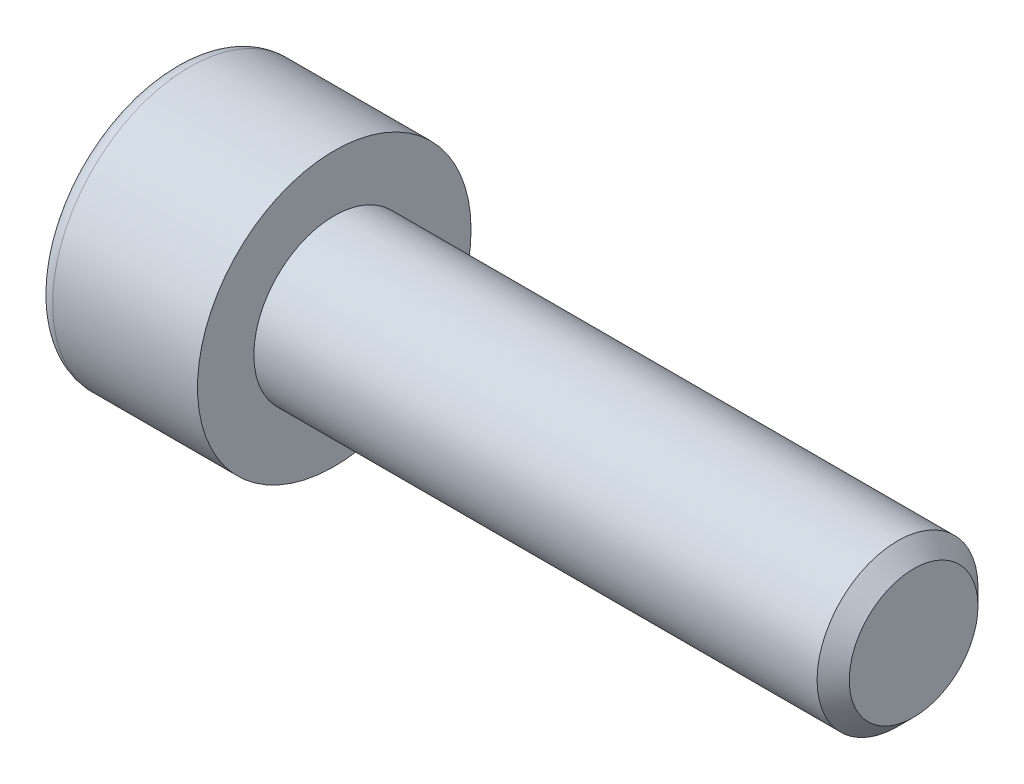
ISO-10303-21;
HEADER;
FILE_DESCRIPTION(('STEP AP214'),'2;1');
FILE_NAME('part.step','',(''),(''),'','','');
FILE_SCHEMA(('AUTOMOTIVE_DESIGN { 1 0 10303 214 1 1 1 1 }'));
ENDSEC;
DATA;
#1=APPLICATION_CONTEXT('core data for automotive mechanical design processes');
#2=APPLICATION_PROTOCOL_DEFINITION('international standard','automotive_design',2000,#1);
#3=PRODUCT_CONTEXT('',#1,'mechanical');
#4=PRODUCT('Part','Part','',(#3));
#5=PRODUCT_RELATED_PRODUCT_CATEGORY('part','',(#4));
#6=PRODUCT_DEFINITION_FORMATION('','',#4);
#7=PRODUCT_DEFINITION_CONTEXT('part definition',#1,'design');
#8=PRODUCT_DEFINITION('design','',#6,#7);
#9=PRODUCT_DEFINITION_SHAPE('','',#8);
#10=(LENGTH_UNIT() NAMED_UNIT(*) SI_UNIT(.MILLI.,.METRE.));
#11=(NAMED_UNIT(*) PLANE_ANGLE_UNIT() SI_UNIT($,.RADIAN.));
#12=(NAMED_UNIT(*) SI_UNIT($,.STERADIAN.) SOLID_ANGLE_UNIT());
#13=UNCERTAINTY_MEASURE_WITH_UNIT(LENGTH_MEASURE(1.E-05),#10,'distance_accuracy_value','');
#14=(GEOMETRIC_REPRESENTATION_CONTEXT(3) GLOBAL_UNCERTAINTY_ASSIGNED_CONTEXT((#13)) GLOBAL_UNIT_ASSIGNED_CONTEXT((#10,
#11,#12)) REPRESENTATION_CONTEXT('',''));
#15=CARTESIAN_POINT('',(0.,0.,0.));
#16=DIRECTION('',(0.,0.,1.));
#17=DIRECTION('',(1.,0.,0.));
#18=AXIS2_PLACEMENT_3D('',#15,#16,#17);
#19=CARTESIAN_POINT('',(-5.,0.,-3.7500000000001));
#20=DIRECTION('',(-1.,0.,0.));
#21=DIRECTION('',(0.,0.,1.));
#22=AXIS2_PLACEMENT_3D('',#19,#20,#21);
#23=PLANE('',#22);
#24=CARTESIAN_POINT('',(-5.,0.,0.));
#25=DIRECTION('',(1.,0.,0.));
#26=DIRECTION('',(0.,0.,-1.));
#27=AXIS2_PLACEMENT_3D('',#24,#25,#26);
#28=CIRCLE('',#27,3.75);
#29=CARTESIAN_POINT('',(-5.,0.,-3.75));
#30=VERTEX_POINT('',#29);
#31=EDGE_CURVE('E468',#30,#30,#28,.T.);
#32=ORIENTED_EDGE('',*,*,#31,.F.);
#33=EDGE_LOOP('',(#32));
#34=FACE_BOUND('',#33,.T.);
#35=DIRECTION('',(0.,0.,-1.));
#36=VECTOR('',#35,1.);
#37=CARTESIAN_POINT('',(-5.,-1.99999999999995,1.15470053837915));
#38=LINE('',#37,#36);
#39=CARTESIAN_POINT('',(-5.,-1.99999999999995,1.15470053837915));
#40=VERTEX_POINT('',#39);
#41=CARTESIAN_POINT('',(-5.,-1.99999999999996,-1.15470053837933));
#42=VERTEX_POINT('',#41);
#43=EDGE_CURVE('E431',#40,#42,#38,.T.);
#44=ORIENTED_EDGE('',*,*,#43,.T.);
#45=DIRECTION('',(0.,0.866025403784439,-0.5));
#46=VECTOR('',#45,1.);
#47=CARTESIAN_POINT('',(-5.,-1.99999999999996,-1.15470053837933));
#48=LINE('',#47,#46);
#49=CARTESIAN_POINT('',(-5.,0.,-2.30940107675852));
#50=VERTEX_POINT('',#49);
#51=EDGE_CURVE('E373',#42,#50,#48,.T.);
#52=ORIENTED_EDGE('',*,*,#51,.T.);
#53=DIRECTION('',(0.,-0.86602540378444,-0.500000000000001));
#54=VECTOR('',#53,1.);
#55=CARTESIAN_POINT('',(-5.,2.,-1.15470053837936));
#56=LINE('',#55,#54);
#57=CARTESIAN_POINT('',(-5.,2.,-1.15470053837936));
#58=VERTEX_POINT('',#57);
#59=EDGE_CURVE('E421',#58,#50,#56,.T.);
#60=ORIENTED_EDGE('',*,*,#59,.F.);
#61=DIRECTION('',(0.,0.,-1.));
#62=VECTOR('',#61,1.);
#63=CARTESIAN_POINT('',(-5.,2.0000000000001,1.1547005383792));
#64=LINE('',#63,#62);
#65=CARTESIAN_POINT('',(-5.,2.0000000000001,1.1547005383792));
#66=VERTEX_POINT('',#65);
#67=EDGE_CURVE('E426',#66,#58,#64,.T.);
#68=ORIENTED_EDGE('',*,*,#67,.F.);
#69=DIRECTION('',(0.,-0.866025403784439,0.5));
#70=VECTOR('',#69,1.);
#71=CARTESIAN_POINT('',(-5.,2.0000000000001,1.1547005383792));
#72=LINE('',#71,#70);
#73=CARTESIAN_POINT('',(-5.,0.,2.30940107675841));
#74=VERTEX_POINT('',#73);
#75=EDGE_CURVE('E435',#66,#74,#72,.T.);
#76=ORIENTED_EDGE('',*,*,#75,.T.);
#77=DIRECTION('',(0.,0.86602540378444,0.500000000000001));
#78=VECTOR('',#77,1.);
#79=CARTESIAN_POINT('',(-5.,-1.99999999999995,1.15470053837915));
#80=LINE('',#79,#78);
#81=EDGE_CURVE('E438',#40,#74,#80,.T.);
#82=ORIENTED_EDGE('',*,*,#81,.F.);
#83=EDGE_LOOP('',(#44,#52,#60,#68,#76,#82));
#84=FACE_BOUND('',#83,.T.);
#85=ADVANCED_FACE('F358',(#34,#84),#23,.T.);
#86=CARTESIAN_POINT('',(0.,0.,0.));
#87=DIRECTION('',(-1.,0.,0.));
#88=DIRECTION('',(0.,0.,1.));
#89=AXIS2_PLACEMENT_3D('',#86,#87,#88);
#90=CYLINDRICAL_SURFACE('',#89,2.50000000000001);
#91=CARTESIAN_POINT('',(17.5,0.,0.));
#92=DIRECTION('',(1.,0.,0.));
#93=DIRECTION('',(0.,0.,-1.));
#94=AXIS2_PLACEMENT_3D('',#91,#92,#93);
#95=CIRCLE('',#94,2.50000000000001);
#96=CARTESIAN_POINT('',(17.5,0.,-2.50000000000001));
#97=VERTEX_POINT('',#96);
#98=EDGE_CURVE('E366',#97,#97,#95,.F.);
#99=ORIENTED_EDGE('',*,*,#98,.T.);
#100=EDGE_LOOP('',(#99));
#101=FACE_BOUND('',#100,.T.);
#102=CARTESIAN_POINT('',(0.,0.,0.));
#103=DIRECTION('',(-1.,0.,0.));
#104=DIRECTION('',(0.,0.,1.));
#105=AXIS2_PLACEMENT_3D('',#102,#103,#104);
#106=CIRCLE('',#105,2.50000000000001);
#107=CARTESIAN_POINT('',(0.,0.,2.50000000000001));
#108=VERTEX_POINT('',#107);
#109=EDGE_CURVE('E471',#108,#108,#106,.T.);
#110=ORIENTED_EDGE('',*,*,#109,.F.);
#111=EDGE_LOOP('',(#110));
#112=FACE_BOUND('',#111,.T.);
#113=ADVANCED_FACE('F360',(#101,#112),#90,.T.);
#114=CARTESIAN_POINT('',(18.,0.,-2.50000000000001));
#115=DIRECTION('',(1.,0.,0.));
#116=DIRECTION('',(0.,0.,-1.));
#117=AXIS2_PLACEMENT_3D('',#114,#115,#116);
#118=PLANE('',#117);
#119=CARTESIAN_POINT('',(18.,0.,0.));
#120=DIRECTION('',(1.,0.,0.));
#121=DIRECTION('',(0.,0.,-1.));
#122=AXIS2_PLACEMENT_3D('',#119,#120,#121);
#123=CIRCLE('',#122,2.);
#124=CARTESIAN_POINT('',(18.,0.,-2.));
#125=VERTEX_POINT('',#124);
#126=EDGE_CURVE('E13',#125,#125,#123,.T.);
#127=ORIENTED_EDGE('',*,*,#126,.T.);
#128=EDGE_LOOP('',(#127));
#129=FACE_BOUND('',#128,.T.);
#130=ADVANCED_FACE('F481',(#129),#118,.T.);
#131=CARTESIAN_POINT('',(17.5,0.,0.));
#132=DIRECTION('',(-1.,0.,0.));
#133=DIRECTION('',(0.,0.,1.));
#134=AXIS2_PLACEMENT_3D('',#131,#132,#133);
#135=CONICAL_SURFACE('',#134,2.50000000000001,0.785398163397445);
#136=ORIENTED_EDGE('',*,*,#126,.F.);
#137=EDGE_LOOP('',(#136));
#138=FACE_BOUND('',#137,.T.);
#139=ORIENTED_EDGE('',*,*,#98,.F.);
#140=EDGE_LOOP('',(#139));
#141=FACE_BOUND('',#140,.T.);
#142=ADVANCED_FACE('F478',(#138,#141),#135,.T.);
#143=CARTESIAN_POINT('',(0.,0.,0.));
#144=DIRECTION('',(1.,0.,0.));
#145=DIRECTION('',(0.,0.,-1.));
#146=AXIS2_PLACEMENT_3D('',#143,#144,#145);
#147=PLANE('',#146);
#148=CARTESIAN_POINT('',(0.,0.,0.));
#149=DIRECTION('',(1.,0.,0.));
#150=DIRECTION('',(0.,0.,-1.));
#151=AXIS2_PLACEMENT_3D('',#148,#149,#150);
#152=CIRCLE('',#151,4.25);
#153=CARTESIAN_POINT('',(0.,0.,-4.25));
#154=VERTEX_POINT('',#153);
#155=EDGE_CURVE('E417',#154,#154,#152,.T.);
#156=ORIENTED_EDGE('',*,*,#155,.T.);
#157=EDGE_LOOP('',(#156));
#158=FACE_BOUND('',#157,.T.);
#159=ORIENTED_EDGE('',*,*,#109,.T.);
#160=EDGE_LOOP('',(#159));
#161=FACE_BOUND('',#160,.T.);
#162=ADVANCED_FACE('F480',(#158,#161),#147,.T.);
#163=CARTESIAN_POINT('',(-4.5,0.,0.));
#164=DIRECTION('',(1.,0.,0.));
#165=DIRECTION('',(0.,0.,-1.));
#166=AXIS2_PLACEMENT_3D('',#163,#164,#165);
#167=TOROIDAL_SURFACE('',#166,3.75,0.499999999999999);
#168=CARTESIAN_POINT('',(-4.5,0.,0.));
#169=DIRECTION('',(1.,0.,0.));
#170=DIRECTION('',(0.,0.,-1.));
#171=AXIS2_PLACEMENT_3D('',#168,#169,#170);
#172=CIRCLE('',#171,4.25);
#173=CARTESIAN_POINT('',(-4.5,0.,-4.25));
#174=VERTEX_POINT('',#173);
#175=EDGE_CURVE('E465',#174,#174,#172,.T.);
#176=ORIENTED_EDGE('',*,*,#175,.F.);
#177=EDGE_LOOP('',(#176));
#178=FACE_BOUND('',#177,.T.);
#179=ORIENTED_EDGE('',*,*,#31,.T.);
#180=EDGE_LOOP('',(#179));
#181=FACE_BOUND('',#180,.T.);
#182=ADVANCED_FACE('F489',(#178,#181),#167,.T.);
#183=CARTESIAN_POINT('',(0.,0.,0.));
#184=DIRECTION('',(1.,0.,0.));
#185=DIRECTION('',(0.,0.,-1.));
#186=AXIS2_PLACEMENT_3D('',#183,#184,#185);
#187=CYLINDRICAL_SURFACE('',#186,4.25);
#188=ORIENTED_EDGE('',*,*,#155,.F.);
#189=EDGE_LOOP('',(#188));
#190=FACE_BOUND('',#189,.T.);
#191=ORIENTED_EDGE('',*,*,#175,.T.);
#192=EDGE_LOOP('',(#191));
#193=FACE_BOUND('',#192,.T.);
#194=ADVANCED_FACE('F504',(#190,#193),#187,.T.);
#195=CARTESIAN_POINT('',(0.,-1.99999999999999,-1.15470053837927));
#196=DIRECTION('',(0.,0.5,0.866025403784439));
#197=DIRECTION('',(0.,-0.866025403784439,0.5));
#198=AXIS2_PLACEMENT_3D('',#195,#196,#197);
#199=PLANE('',#198);
#200=ORIENTED_EDGE('',*,*,#51,.F.);
#201=DIRECTION('',(-1.,0.,0.));
#202=VECTOR('',#201,1.);
#203=CARTESIAN_POINT('',(0.,-1.99999999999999,-1.15470053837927));
#204=LINE('',#203,#202);
#205=CARTESIAN_POINT('',(0.,-1.99999999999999,-1.15470053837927));
#206=VERTEX_POINT('',#205);
#207=EDGE_CURVE('E454',#206,#42,#204,.T.);
#208=ORIENTED_EDGE('',*,*,#207,.F.);
#209=DIRECTION('',(0.,0.866025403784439,-0.5));
#210=VECTOR('',#209,1.);
#211=CARTESIAN_POINT('',(0.,-1.99999999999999,-1.15470053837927));
#212=LINE('',#211,#210);
#213=CARTESIAN_POINT('',(0.,0.,-2.30940107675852));
#214=VERTEX_POINT('',#213);
#215=EDGE_CURVE('E413',#206,#214,#212,.T.);
#216=ORIENTED_EDGE('',*,*,#215,.T.);
#217=DIRECTION('',(-1.,0.,0.));
#218=VECTOR('',#217,1.);
#219=CARTESIAN_POINT('',(0.,0.,-2.30940107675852));
#220=LINE('',#219,#218);
#221=EDGE_CURVE('E409',#214,#50,#220,.T.);
#222=ORIENTED_EDGE('',*,*,#221,.T.);
#223=EDGE_LOOP('',(#200,#208,#216,#222));
#224=FACE_BOUND('',#223,.T.);
#225=ADVANCED_FACE('F411',(#224),#199,.T.);
#226=CARTESIAN_POINT('',(0.,1.99999999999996,-1.15470053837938));
#227=DIRECTION('',(0.,0.500000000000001,-0.86602540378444));
#228=DIRECTION('',(0.,0.86602540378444,0.500000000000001));
#229=AXIS2_PLACEMENT_3D('',#226,#227,#228);
#230=PLANE('',#229);
#231=ORIENTED_EDGE('',*,*,#59,.T.);
#232=ORIENTED_EDGE('',*,*,#221,.F.);
#233=DIRECTION('',(0.,-0.86602540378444,-0.500000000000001));
#234=VECTOR('',#233,1.);
#235=CARTESIAN_POINT('',(0.,1.99999999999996,-1.15470053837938));
#236=LINE('',#235,#234);
#237=CARTESIAN_POINT('',(0.,1.99999999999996,-1.15470053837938));
#238=VERTEX_POINT('',#237);
#239=EDGE_CURVE('E443',#238,#214,#236,.T.);
#240=ORIENTED_EDGE('',*,*,#239,.F.);
#241=DIRECTION('',(-1.,0.,0.));
#242=VECTOR('',#241,1.);
#243=CARTESIAN_POINT('',(0.,1.99999999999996,-1.15470053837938));
#244=LINE('',#243,#242);
#245=EDGE_CURVE('E418',#238,#58,#244,.T.);
#246=ORIENTED_EDGE('',*,*,#245,.T.);
#247=EDGE_LOOP('',(#231,#232,#240,#246));
#248=FACE_BOUND('',#247,.T.);
#249=ADVANCED_FACE('F422',(#248),#230,.F.);
#250=CARTESIAN_POINT('',(0.,2.00000000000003,1.15470053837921));
#251=DIRECTION('',(0.,1.,0.));
#252=DIRECTION('',(-1.,0.,0.));
#253=AXIS2_PLACEMENT_3D('',#250,#251,#252);
#254=PLANE('',#253);
#255=ORIENTED_EDGE('',*,*,#67,.T.);
#256=ORIENTED_EDGE('',*,*,#245,.F.);
#257=DIRECTION('',(0.,0.,-1.));
#258=VECTOR('',#257,1.);
#259=CARTESIAN_POINT('',(0.,2.00000000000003,1.15470053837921));
#260=LINE('',#259,#258);
#261=CARTESIAN_POINT('',(0.,2.00000000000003,1.15470053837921));
#262=VERTEX_POINT('',#261);
#263=EDGE_CURVE('E445',#262,#238,#260,.T.);
#264=ORIENTED_EDGE('',*,*,#263,.F.);
#265=DIRECTION('',(-1.,0.,0.));
#266=VECTOR('',#265,1.);
#267=CARTESIAN_POINT('',(0.,2.00000000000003,1.15470053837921));
#268=LINE('',#267,#266);
#269=EDGE_CURVE('E460',#262,#66,#268,.T.);
#270=ORIENTED_EDGE('',*,*,#269,.T.);
#271=EDGE_LOOP('',(#255,#256,#264,#270));
#272=FACE_BOUND('',#271,.T.);
#273=ADVANCED_FACE('F512',(#272),#254,.F.);
#274=CARTESIAN_POINT('',(0.,2.00000000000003,1.15470053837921));
#275=DIRECTION('',(0.,-0.5,-0.866025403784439));
#276=DIRECTION('',(0.,0.866025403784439,-0.5));
#277=AXIS2_PLACEMENT_3D('',#274,#275,#276);
#278=PLANE('',#277);
#279=ORIENTED_EDGE('',*,*,#75,.F.);
#280=ORIENTED_EDGE('',*,*,#269,.F.);
#281=DIRECTION('',(0.,-0.866025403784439,0.5));
#282=VECTOR('',#281,1.);
#283=CARTESIAN_POINT('',(0.,2.00000000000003,1.15470053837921));
#284=LINE('',#283,#282);
#285=CARTESIAN_POINT('',(0.,0.,2.3094010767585));
#286=VERTEX_POINT('',#285);
#287=EDGE_CURVE('E448',#262,#286,#284,.T.);
#288=ORIENTED_EDGE('',*,*,#287,.T.);
#289=DIRECTION('',(-1.,0.,0.));
#290=VECTOR('',#289,1.);
#291=CARTESIAN_POINT('',(0.,0.,2.3094010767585));
#292=LINE('',#291,#290);
#293=EDGE_CURVE('E458',#286,#74,#292,.T.);
#294=ORIENTED_EDGE('',*,*,#293,.T.);
#295=EDGE_LOOP('',(#279,#280,#288,#294));
#296=FACE_BOUND('',#295,.T.);
#297=ADVANCED_FACE('F515',(#296),#278,.T.);
#298=CARTESIAN_POINT('',(0.,-1.99999999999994,1.15470053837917));
#299=DIRECTION('',(0.,-0.500000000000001,0.86602540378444));
#300=DIRECTION('',(0.,-0.86602540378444,-0.500000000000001));
#301=AXIS2_PLACEMENT_3D('',#298,#299,#300);
#302=PLANE('',#301);
#303=ORIENTED_EDGE('',*,*,#81,.T.);
#304=ORIENTED_EDGE('',*,*,#293,.F.);
#305=DIRECTION('',(0.,0.86602540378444,0.500000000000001));
#306=VECTOR('',#305,1.);
#307=CARTESIAN_POINT('',(0.,-1.99999999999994,1.15470053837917));
#308=LINE('',#307,#306);
#309=CARTESIAN_POINT('',(0.,-1.99999999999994,1.15470053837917));
#310=VERTEX_POINT('',#309);
#311=EDGE_CURVE('E450',#310,#286,#308,.T.);
#312=ORIENTED_EDGE('',*,*,#311,.F.);
#313=DIRECTION('',(-1.,0.,0.));
#314=VECTOR('',#313,1.);
#315=CARTESIAN_POINT('',(0.,-1.99999999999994,1.15470053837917));
#316=LINE('',#315,#314);
#317=EDGE_CURVE('E456',#310,#40,#316,.T.);
#318=ORIENTED_EDGE('',*,*,#317,.T.);
#319=EDGE_LOOP('',(#303,#304,#312,#318));
#320=FACE_BOUND('',#319,.T.);
#321=ADVANCED_FACE('F519',(#320),#302,.F.);
#322=CARTESIAN_POINT('',(0.,-1.99999999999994,1.15470053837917));
#323=DIRECTION('',(0.,1.,0.));
#324=DIRECTION('',(-1.,0.,0.));
#325=AXIS2_PLACEMENT_3D('',#322,#323,#324);
#326=PLANE('',#325);
#327=ORIENTED_EDGE('',*,*,#43,.F.);
#328=ORIENTED_EDGE('',*,*,#317,.F.);
#329=DIRECTION('',(0.,0.,-1.));
#330=VECTOR('',#329,1.);
#331=CARTESIAN_POINT('',(0.,-1.99999999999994,1.15470053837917));
#332=LINE('',#331,#330);
#333=EDGE_CURVE('E380',#310,#206,#332,.T.);
#334=ORIENTED_EDGE('',*,*,#333,.T.);
#335=ORIENTED_EDGE('',*,*,#207,.T.);
#336=EDGE_LOOP('',(#327,#328,#334,#335));
#337=FACE_BOUND('',#336,.T.);
#338=ADVANCED_FACE('F523',(#337),#326,.T.);
#339=CARTESIAN_POINT('',(0.,2.00000000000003,-3.46410161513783));
#340=DIRECTION('',(-1.,0.,0.));
#341=DIRECTION('',(0.,0.,1.));
#342=AXIS2_PLACEMENT_3D('',#339,#340,#341);
#343=PLANE('',#342);
#344=ORIENTED_EDGE('',*,*,#215,.F.);
#345=ORIENTED_EDGE('',*,*,#333,.F.);
#346=ORIENTED_EDGE('',*,*,#311,.T.);
#347=ORIENTED_EDGE('',*,*,#287,.F.);
#348=ORIENTED_EDGE('',*,*,#263,.T.);
#349=ORIENTED_EDGE('',*,*,#239,.T.);
#350=EDGE_LOOP('',(#344,#345,#346,#347,#348,#349));
#351=FACE_BOUND('',#350,.T.);
#352=ADVANCED_FACE('F527',(#351),#343,.T.);
#353=CLOSED_SHELL('',(#85,#113,#130,#142,#162,#182,#194,#225,#249,#273,#297,#321,#338,#352));
#354=MANIFOLD_SOLID_BREP('B2',#353);
#355=ADVANCED_BREP_SHAPE_REPRESENTATION('',(#18,#354),#14);
#356=SHAPE_DEFINITION_REPRESENTATION(#9,#355);
ENDSEC;
END-ISO-10303-21;
